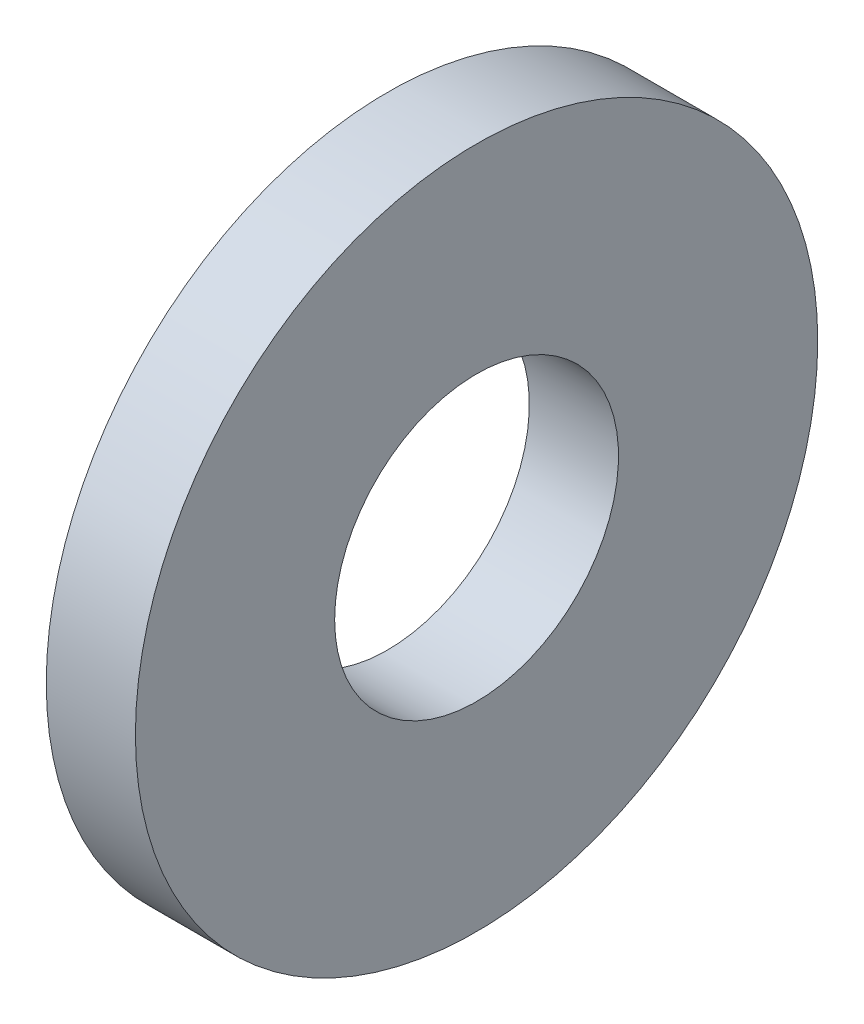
from build123d import *

# Parameters (mm, degrees)
SKETCH1_W = 1.2446
SKETCH1_H = 2.7813


with BuildPart() as part:
    # Sketch1 → Base-Revolve (revolve)
    with BuildSketch(Plane.XY, mode=Mode.PRIVATE) as base_revolve_sk:
        with Locations((-0.6223, 3.37185)):
            Rectangle(SKETCH1_W, SKETCH1_H)
    revolve(base_revolve_sk.sketch.rotate(Axis((-34.925, 0, 0), (1, 0, 0)), 90), axis=Axis((-34.925, 0, 0), (1, 0, 0)))


solid = part.part
